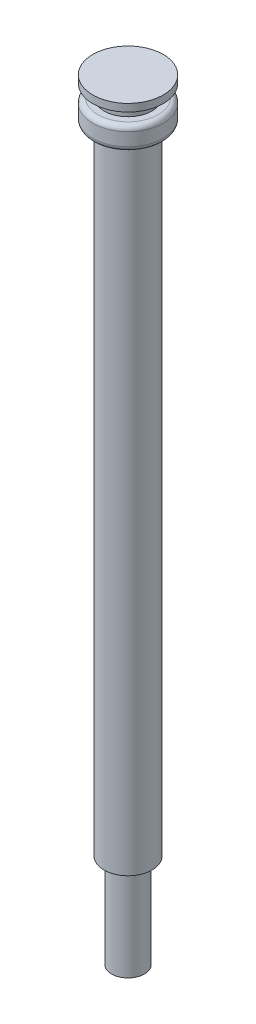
from build123d import *

# Parameters (mm, degrees)
FILLET1_R = 0.508


with BuildPart() as part:
    # Sketch1 → Revolve1 (revolve)
    with BuildSketch(Plane.XY, mode=Mode.PRIVATE) as revolve1_sk:
        Polygon((2.4384, 73.8632), (2.4384, 9.525), (1.6637, 9.525), (1.6637, 0), (0, 0), (0, 78.1812), (3.5687, 78.1812), (3.5687, 77.4192), (2.4257, 77.4192), (2.4257, 76.2), (3.5687, 76.2), (3.5687, 73.8632), align=None)
    revolve(revolve1_sk.sketch.rotate(Axis((0, 0, 0), (0, 1, 0)), 90), axis=Axis((0, 0, 0), (0, 1, 0)))

    # Fillet1
    fillet1_edges = [part.edges().sort_by_distance(p)[0] for p in [
        (0, 76.2, 3.5687),
        (0, 73.8632, 3.5687),
    ]]
    fillet(fillet1_edges, radius=FILLET1_R)


solid = part.part
